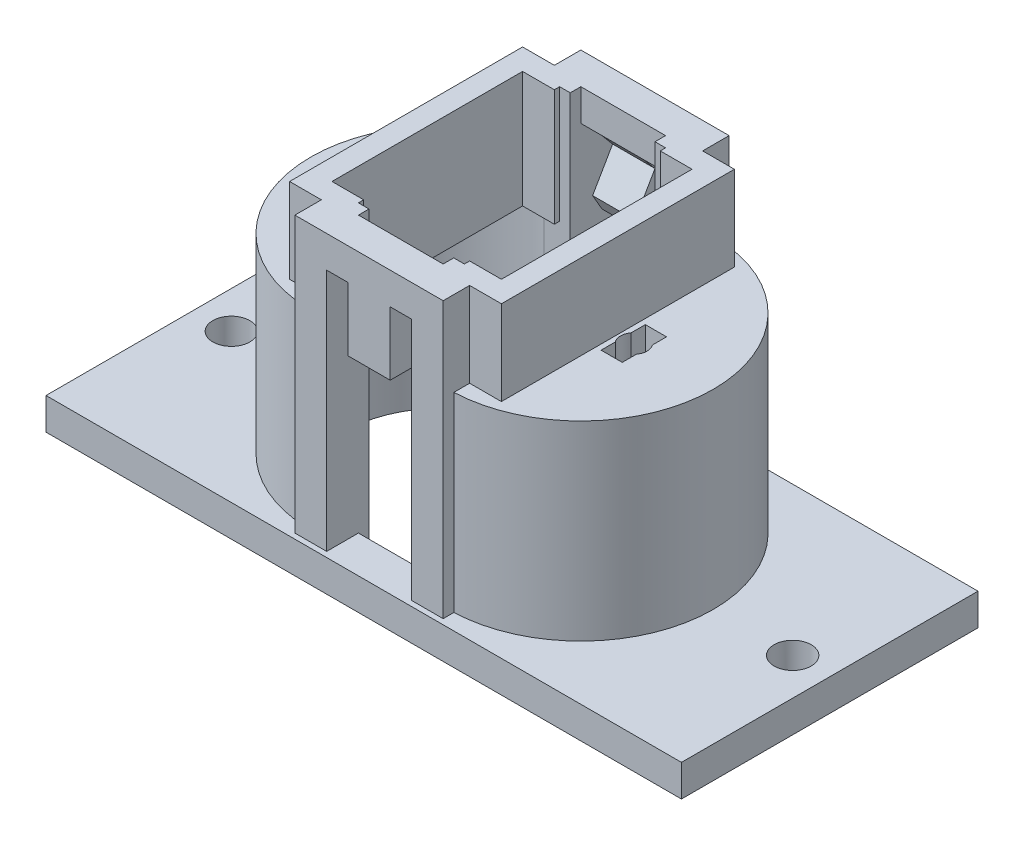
from build123d import *

# Parameters (mm, degrees)
SKETCH1_W           = 60
SKETCH1_H           = 28
BOSS_EXTRUDE1_DEPTH = 3
BOSS_EXTRUDE2_DEPTH = 15
BOSS_EXTRUDE3_DEPTH = 3
BOSS_EXTRUDE4_DEPTH = 5
BOSS_EXTRUDE5_DEPTH = 8.5
BOSS_EXTRUDE6_DEPTH = 2
CUT_EXTRUDE1_DEPTH  = 16.5
CUT_EXTRUDE2_DEPTH  = 5.5
SKETCH9_R           = 1.75
CUT_EXTRUDE3_DEPTH  = 10


with BuildPart() as part:
    # Sketch1 → Boss-Extrude1 (new body)
    with BuildSketch(Plane(origin=(0, 0, 0), x_dir=(1, 0, 0), z_dir=(0, 1, 0))):
        Rectangle(SKETCH1_W, SKETCH1_H)
        with BuildLine():
            Line((-6.5, 9.5), (-4, 9.5))
            Line((-4, 9.5), (-4, 10.5))
            Line((-4, 10.5), (4, 10.5))
            Line((4, 10.5), (4, 9.5))
            Line((4, 9.5), (6.5, 9.5))
            ThreePointArc((6.5, 9.5), (16, 0), (6.5, -9.5))
            Line((6.5, -9.5), (4, -9.5))
            Line((4, -9.5), (4, -10.5))
            Line((4, -10.5), (-4, -10.5))
            Line((-4, -10.5), (-4, -9.5))
            Line((-4, -9.5), (-6.5, -9.5))
            ThreePointArc((-6.5, -9.5), (-16, 0), (-6.5, 9.5))
        make_face(mode=Mode.SUBTRACT)
    extrude(amount=BOSS_EXTRUDE1_DEPTH)

    # Sketch2 → Boss-Extrude2 (add)
    with BuildSketch(Plane(origin=(0, 3, 0), x_dir=(1, 0, 0), z_dir=(0, 1, 0))):
        with BuildLine():
            Line((4, -9.5), (4, -10.5))
            Line((4, -10.5), (4, -13.5))
            Line((4, -13.5), (7, -13.5))
            Line((7, -13.5), (7, -12.489995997))
            ThreePointArc((7, -12.489995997), (19, 0), (7, 12.489995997))
            Line((7, 12.489995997), (7, 13.5))
            Line((7, 13.5), (4, 13.5))
            Line((4, 13.5), (4, 10.5))
            Line((4, 10.5), (4, 9.5))
            Line((4, 9.5), (6.5, 9.5))
            ThreePointArc((6.5, 9.5), (16, 0), (6.5, -9.5))
            Line((6.5, -9.5), (4, -9.5))
        make_face()
        with BuildLine():
            Line((-4, -9.5), (-6.5, -9.5))
            ThreePointArc((-6.5, -9.5), (-16, 0), (-6.5, 9.5))
            Line((-6.5, 9.5), (-4, 9.5))
            Line((-4, 9.5), (-4, 13.5))
            Line((-4, 13.5), (-7, 13.5))
            Line((-7, 13.5), (-7, 12.489995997))
            ThreePointArc((-7, 12.489995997), (-19, 0), (-7, -12.489995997))
            Line((-7, -12.489995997), (-7, -13.5))
            Line((-7, -13.5), (-4, -13.5))
            Line((-4, -13.5), (-4, -10.5))
            Line((-4, -10.5), (-4, -9.5))
        make_face()
    extrude(amount=BOSS_EXTRUDE2_DEPTH)

    # Sketch3 → Boss-Extrude3 (add)
    # profile 1 of 2: a face of its own
    with BuildSketch(Plane(origin=(0, 18, 0), x_dir=(1, 0, 0), z_dir=(0, 1, 0))):
        with BuildLine():
            Line((-4, 13.5), (-7, 13.5))
            Line((-7, 13.5), (-7, 12.489995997))
            ThreePointArc((-7, 12.489995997), (-19, 0), (-7, -12.489995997))
            Line((-7, -12.489995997), (-7, -13.5))
            Line((-7, -13.5), (-4, -13.5))
            Line((-4, -13.5), (-4, -8))
            Line((-4, -8), (-7, -8))
            Line((-7, -8), (-7, 8))
            Line((-7, 8), (-4, 8))
            Line((-4, 8), (-4, 13.5))
        make_face()
        with BuildLine():
            Line((-10.5, -2.09), (-12.5, -2.09))
            Line((-12.5, -2.09), (-12.5, -0.75))
            ThreePointArc((-12.5, -0.75), (-12.75, 0), (-12.5, 0.75))
            Line((-12.5, 0.75), (-12.5, 2.09))
            Line((-12.5, 2.09), (-10.5, 2.09))
            Line((-10.5, 2.09), (-10.5, 0.75))
            ThreePointArc((-10.5, 0.75), (-10.25, 0), (-10.5, -0.75))
            Line((-10.5, -0.75), (-10.5, -2.09))
        make_face(mode=Mode.SUBTRACT)
    # profile 2 of 2: a face of its own
    with BuildSketch(Plane(origin=(0, 18, 0), x_dir=(1, 0, 0), z_dir=(0, 1, 0))):
        with BuildLine():
            Line((4, 13.5), (4, 8))
            Line((4, 8), (7, 8))
            Line((7, 8), (7, -8))
            Line((7, -8), (4, -8))
            Line((4, -8), (4, -13.5))
            Line((4, -13.5), (7, -13.5))
            Line((7, -13.5), (7, -12.489995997))
            ThreePointArc((7, -12.489995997), (19, 0), (7, 12.489995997))
            Line((7, 12.489995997), (7, 13.5))
            Line((7, 13.5), (4, 13.5))
        make_face()
        with BuildLine():
            Line((10.5, 2.09), (12.5, 2.09))
            Line((12.5, 2.09), (12.5, 0.75))
            ThreePointArc((12.5, 0.75), (12.75, 0), (12.5, -0.75))
            Line((12.5, -0.75), (12.5, -2.09))
            Line((12.5, -2.09), (10.5, -2.09))
            Line((10.5, -2.09), (10.5, -0.75))
            ThreePointArc((10.5, -0.75), (10.25, 0), (10.5, 0.75))
            Line((10.5, 0.75), (10.5, 2.09))
        make_face(mode=Mode.SUBTRACT)
    extrude(amount=BOSS_EXTRUDE3_DEPTH)

    # Sketch4 → Boss-Extrude4 (add)
    with BuildSketch(Plane(origin=(0, 21, 0), x_dir=(1, 0, 0), z_dir=(0, 1, 0))):
        Polygon((-4, 13.5), (-4, 8), (-7, 8), (-7, -8), (-4, -8), (-4, -13.5), (-7, -13.5), (-7, -11), (-10, -11), (-10, 11), (-7, 11), (-7, 13.5), align=None)
        Polygon((4, -13.5), (4, -8), (7, -8), (7, 8), (4, 8), (4, 13.5), (7, 13.5), (7, 11), (10, 11), (10, -11), (7, -11), (7, -13.5), align=None)
    extrude(amount=BOSS_EXTRUDE4_DEPTH)

    # Sketch5 → Boss-Extrude5 (add)
    with BuildSketch(Plane(origin=(0, 26, 0), x_dir=(1, 0, 0), z_dir=(0, 1, 0))):
        Polygon((-4, 8), (-4, 13.5), (-7, 13.5), (-7, 11), (-10, 11), (-10, -11), (-7, -11), (-7, -13.5), (-4, -13.5), (-4, -8), (-7, -8), (-7, 8), align=None)
        Polygon((10, 11), (7, 11), (7, 13.5), (-4, 13.5), (-4, 10.5), (4, 10.5), (4, 8), (7, 8), (7, -8), (4, -8), (4, -10.5), (-4, -10.5), (-4, -13.5), (7, -13.5), (7, -11), (10, -11), align=None)
    extrude(amount=BOSS_EXTRUDE5_DEPTH)

    # Sketch6 → Boss-Extrude6 (add, symmetric)
    with BuildSketch(Plane(origin=(0, 0, 0), x_dir=(0, 0, -1), z_dir=(1, 0, 0))):
        Polygon((11.5, 24.808246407), (10.5, 26), (13.5, 26), (13.5, 20), (10.5, 20), (9.611978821, 21.5380978), align=None)
        Polygon((-10.5, 26), (-13.5, 26), (-13.5, 20), (-10.5, 20), (-9.611978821, 21.5380978), (-11.5, 24.808246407), align=None)
        Polygon((13.5, 26), (13.5, 20), (10.5, 20), (9.611978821, 21.5380978), (11.5, 24.808246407), (10.5, 26), align=None)
    extrude(amount=BOSS_EXTRUDE6_DEPTH, both=True)

    # Sketch7 → Cut-Extrude1 (cut)
    with BuildSketch(Plane.XZ.offset(-18)):
        Polygon((-4, -9.5), (-4, -8), (-7, -8), (-7, 8), (-4, 8), (-4, 9.5), (-5, 9.5), (-5, 9), (-8, 9), (-8, -9), (-5, -9), (-5, -9.5), align=None)
        Polygon((4, -8), (4, -9.5), (5, -9.5), (5, -9), (8, -9), (8, 9), (5, 9), (5, 9.5), (4, 9.5), (4, 8), (7, 8), (7, -8), align=None)
    extrude(amount=-CUT_EXTRUDE1_DEPTH, mode=Mode.SUBTRACT)

    # Sketch8 → Cut-Extrude2 (cut)
    with BuildSketch(Plane(origin=(0, 34.5, 0), x_dir=(1, 0, 0), z_dir=(0, 1, 0))):
        Polygon((7, 11), (7, 13.5), (-7, 13.5), (-7, 11), (-10, 11), (-10, -11), (-7, -11), (-7, -13.5), (7, -13.5), (7, -11), (10, -11), (10, 11), align=None)
    extrude(amount=-CUT_EXTRUDE2_DEPTH, mode=Mode.SUBTRACT)

    # Sketch9 → Cut-Extrude3 (cut)
    with BuildSketch(Plane(origin=(0, 3, 0), x_dir=(1, 0, 0), z_dir=(0, 1, 0))):
        with Locations(Location((-26.5, 0, 0), (0, 0, 270))):
            Circle(SKETCH9_R)
        with Locations(Location((26.5, 0, 0), (0, 0, 270))):
            Circle(SKETCH9_R)
    extrude(amount=-CUT_EXTRUDE3_DEPTH, mode=Mode.SUBTRACT)


solid = part.part
